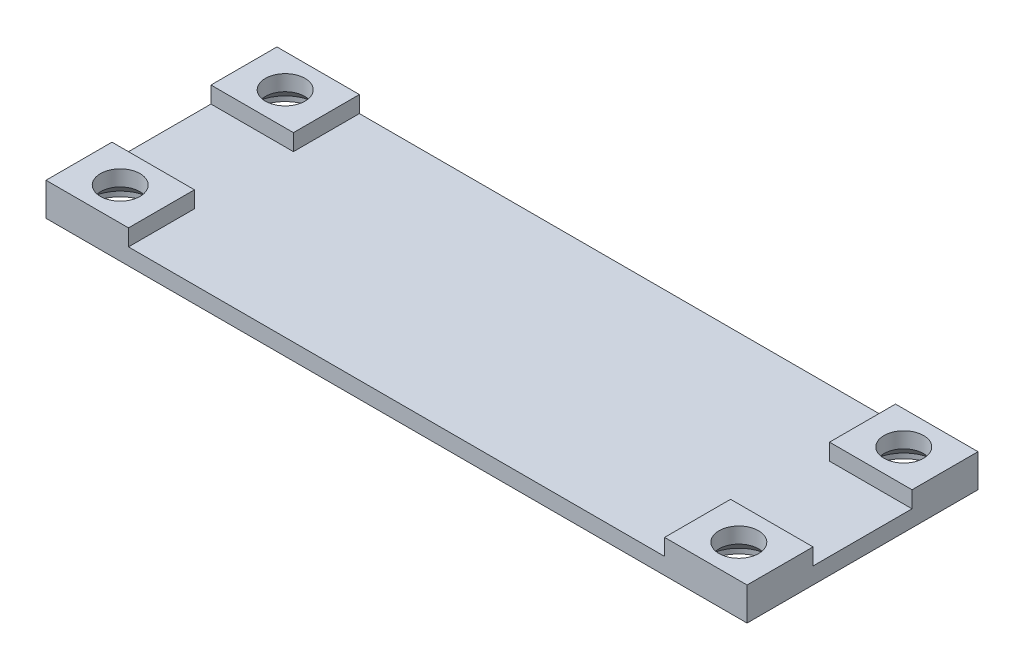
ISO-10303-21;
HEADER;
FILE_DESCRIPTION(('STEP AP214'),'2;1');
FILE_NAME('part.step','',(''),(''),'','','');
FILE_SCHEMA(('AUTOMOTIVE_DESIGN { 1 0 10303 214 1 1 1 1 }'));
ENDSEC;
DATA;
#1=APPLICATION_CONTEXT('core data for automotive mechanical design processes');
#2=APPLICATION_PROTOCOL_DEFINITION('international standard','automotive_design',2000,#1);
#3=PRODUCT_CONTEXT('',#1,'mechanical');
#4=PRODUCT('Part','Part','',(#3));
#5=PRODUCT_RELATED_PRODUCT_CATEGORY('part','',(#4));
#6=PRODUCT_DEFINITION_FORMATION('','',#4);
#7=PRODUCT_DEFINITION_CONTEXT('part definition',#1,'design');
#8=PRODUCT_DEFINITION('design','',#6,#7);
#9=PRODUCT_DEFINITION_SHAPE('','',#8);
#10=(LENGTH_UNIT() NAMED_UNIT(*) SI_UNIT(.MILLI.,.METRE.));
#11=(NAMED_UNIT(*) PLANE_ANGLE_UNIT() SI_UNIT($,.RADIAN.));
#12=(NAMED_UNIT(*) SI_UNIT($,.STERADIAN.) SOLID_ANGLE_UNIT());
#13=UNCERTAINTY_MEASURE_WITH_UNIT(LENGTH_MEASURE(1.E-05),#10,'distance_accuracy_value','');
#14=(GEOMETRIC_REPRESENTATION_CONTEXT(3) GLOBAL_UNCERTAINTY_ASSIGNED_CONTEXT((#13)) GLOBAL_UNIT_ASSIGNED_CONTEXT((#10,
#11,#12)) REPRESENTATION_CONTEXT('',''));
#15=CARTESIAN_POINT('',(0.,0.,0.));
#16=DIRECTION('',(0.,0.,1.));
#17=DIRECTION('',(1.,0.,0.));
#18=AXIS2_PLACEMENT_3D('',#15,#16,#17);
#19=CARTESIAN_POINT('',(0.,1.,-14.));
#20=DIRECTION('',(0.,-1.,0.));
#21=DIRECTION('',(0.,0.,-1.));
#22=AXIS2_PLACEMENT_3D('',#19,#20,#21);
#23=PLANE('',#22);
#24=DIRECTION('',(0.,0.,1.));
#25=VECTOR('',#24,1.);
#26=CARTESIAN_POINT('',(37.5,1.,-14.));
#27=LINE('',#26,#25);
#28=CARTESIAN_POINT('',(37.5,1.,-14.));
#29=VERTEX_POINT('',#28);
#30=CARTESIAN_POINT('',(37.5,1.,-10.));
#31=VERTEX_POINT('',#30);
#32=EDGE_CURVE('E303',#29,#31,#27,.T.);
#33=ORIENTED_EDGE('',*,*,#32,.F.);
#34=DIRECTION('',(-1.,0.,0.));
#35=VECTOR('',#34,1.);
#36=CARTESIAN_POINT('',(0.,1.,-14.));
#37=LINE('',#36,#35);
#38=CARTESIAN_POINT('',(5.,1.,-14.));
#39=VERTEX_POINT('',#38);
#40=EDGE_CURVE('E168',#29,#39,#37,.T.);
#41=ORIENTED_EDGE('',*,*,#40,.T.);
#42=DIRECTION('',(0.,0.,-1.));
#43=VECTOR('',#42,1.);
#44=CARTESIAN_POINT('',(5.,1.,-14.));
#45=LINE('',#44,#43);
#46=CARTESIAN_POINT('',(5.,1.,-10.));
#47=VERTEX_POINT('',#46);
#48=EDGE_CURVE('E227',#47,#39,#45,.T.);
#49=ORIENTED_EDGE('',*,*,#48,.F.);
#50=DIRECTION('',(1.,0.,0.));
#51=VECTOR('',#50,1.);
#52=CARTESIAN_POINT('',(0.,1.,-10.));
#53=LINE('',#52,#51);
#54=CARTESIAN_POINT('',(0.,1.,-10.));
#55=VERTEX_POINT('',#54);
#56=EDGE_CURVE('E222',#55,#47,#53,.T.);
#57=ORIENTED_EDGE('',*,*,#56,.F.);
#58=DIRECTION('',(0.,0.,1.));
#59=VECTOR('',#58,1.);
#60=CARTESIAN_POINT('',(0.,1.,0.));
#61=LINE('',#60,#59);
#62=CARTESIAN_POINT('',(0.,1.,-4.));
#63=VERTEX_POINT('',#62);
#64=EDGE_CURVE('E267',#55,#63,#61,.T.);
#65=ORIENTED_EDGE('',*,*,#64,.T.);
#66=DIRECTION('',(-1.,0.,0.));
#67=VECTOR('',#66,1.);
#68=CARTESIAN_POINT('',(0.,1.,-4.));
#69=LINE('',#68,#67);
#70=CARTESIAN_POINT('',(5.,1.,-4.));
#71=VERTEX_POINT('',#70);
#72=EDGE_CURVE('E203',#71,#63,#69,.T.);
#73=ORIENTED_EDGE('',*,*,#72,.F.);
#74=DIRECTION('',(0.,0.,-1.));
#75=VECTOR('',#74,1.);
#76=CARTESIAN_POINT('',(5.,1.,0.));
#77=LINE('',#76,#75);
#78=CARTESIAN_POINT('',(5.,1.,0.));
#79=VERTEX_POINT('',#78);
#80=EDGE_CURVE('E198',#79,#71,#77,.T.);
#81=ORIENTED_EDGE('',*,*,#80,.F.);
#82=DIRECTION('',(1.,0.,0.));
#83=VECTOR('',#82,1.);
#84=CARTESIAN_POINT('',(0.,1.,0.));
#85=LINE('',#84,#83);
#86=CARTESIAN_POINT('',(37.5,1.,0.));
#87=VERTEX_POINT('',#86);
#88=EDGE_CURVE('E275',#79,#87,#85,.T.);
#89=ORIENTED_EDGE('',*,*,#88,.T.);
#90=DIRECTION('',(0.,0.,1.));
#91=VECTOR('',#90,1.);
#92=CARTESIAN_POINT('',(37.5,1.,0.));
#93=LINE('',#92,#91);
#94=CARTESIAN_POINT('',(37.5,1.,-4.));
#95=VERTEX_POINT('',#94);
#96=EDGE_CURVE('E172',#95,#87,#93,.T.);
#97=ORIENTED_EDGE('',*,*,#96,.F.);
#98=DIRECTION('',(-1.,0.,0.));
#99=VECTOR('',#98,1.);
#100=CARTESIAN_POINT('',(42.5,1.,-4.00000000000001));
#101=LINE('',#100,#99);
#102=CARTESIAN_POINT('',(42.5,1.,-4.00000000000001));
#103=VERTEX_POINT('',#102);
#104=EDGE_CURVE('E169',#103,#95,#101,.T.);
#105=ORIENTED_EDGE('',*,*,#104,.F.);
#106=DIRECTION('',(0.,0.,-1.));
#107=VECTOR('',#106,1.);
#108=CARTESIAN_POINT('',(42.5,1.,0.));
#109=LINE('',#108,#107);
#110=CARTESIAN_POINT('',(42.5,1.,-10.));
#111=VERTEX_POINT('',#110);
#112=EDGE_CURVE('E54',#103,#111,#109,.T.);
#113=ORIENTED_EDGE('',*,*,#112,.T.);
#114=DIRECTION('',(1.,0.,0.));
#115=VECTOR('',#114,1.);
#116=CARTESIAN_POINT('',(42.5,1.,-10.));
#117=LINE('',#116,#115);
#118=EDGE_CURVE('E49',#31,#111,#117,.T.);
#119=ORIENTED_EDGE('',*,*,#118,.F.);
#120=EDGE_LOOP('',(#33,#41,#49,#57,#65,#73,#81,#89,#97,#105,#113,#119));
#121=FACE_BOUND('',#120,.T.);
#122=ADVANCED_FACE('F32',(#121),#23,.F.);
#123=CARTESIAN_POINT('',(0.,1.,0.));
#124=DIRECTION('',(1.,0.,0.));
#125=DIRECTION('',(0.,0.,-1.));
#126=AXIS2_PLACEMENT_3D('',#123,#124,#125);
#127=PLANE('',#126);
#128=DIRECTION('',(0.,0.,1.));
#129=VECTOR('',#128,1.);
#130=CARTESIAN_POINT('',(0.,0.,0.));
#131=LINE('',#130,#129);
#132=CARTESIAN_POINT('',(0.,0.,-14.));
#133=VERTEX_POINT('',#132);
#134=CARTESIAN_POINT('',(0.,0.,0.));
#135=VERTEX_POINT('',#134);
#136=EDGE_CURVE('E257',#133,#135,#131,.T.);
#137=ORIENTED_EDGE('',*,*,#136,.T.);
#138=DIRECTION('',(0.,-1.,0.));
#139=VECTOR('',#138,1.);
#140=CARTESIAN_POINT('',(0.,1.,0.));
#141=LINE('',#140,#139);
#142=CARTESIAN_POINT('',(0.,2.,0.));
#143=VERTEX_POINT('',#142);
#144=EDGE_CURVE('E11',#143,#135,#141,.T.);
#145=ORIENTED_EDGE('',*,*,#144,.F.);
#146=DIRECTION('',(0.,0.,1.));
#147=VECTOR('',#146,1.);
#148=CARTESIAN_POINT('',(0.,2.,0.));
#149=LINE('',#148,#147);
#150=CARTESIAN_POINT('',(0.,2.,-4.));
#151=VERTEX_POINT('',#150);
#152=EDGE_CURVE('E199',#151,#143,#149,.T.);
#153=ORIENTED_EDGE('',*,*,#152,.F.);
#154=DIRECTION('',(0.,-1.,0.));
#155=VECTOR('',#154,1.);
#156=CARTESIAN_POINT('',(0.,2.,-4.));
#157=LINE('',#156,#155);
#158=EDGE_CURVE('E209',#151,#63,#157,.T.);
#159=ORIENTED_EDGE('',*,*,#158,.T.);
#160=ORIENTED_EDGE('',*,*,#64,.F.);
#161=DIRECTION('',(0.,-1.,0.));
#162=VECTOR('',#161,1.);
#163=CARTESIAN_POINT('',(0.,2.,-10.));
#164=LINE('',#163,#162);
#165=CARTESIAN_POINT('',(0.,2.,-10.));
#166=VERTEX_POINT('',#165);
#167=EDGE_CURVE('E261',#166,#55,#164,.T.);
#168=ORIENTED_EDGE('',*,*,#167,.F.);
#169=DIRECTION('',(0.,0.,1.));
#170=VECTOR('',#169,1.);
#171=CARTESIAN_POINT('',(0.,2.,-14.));
#172=LINE('',#171,#170);
#173=CARTESIAN_POINT('',(0.,2.,-14.));
#174=VERTEX_POINT('',#173);
#175=EDGE_CURVE('E223',#174,#166,#172,.T.);
#176=ORIENTED_EDGE('',*,*,#175,.F.);
#177=DIRECTION('',(0.,-1.,0.));
#178=VECTOR('',#177,1.);
#179=CARTESIAN_POINT('',(0.,1.,-14.));
#180=LINE('',#179,#178);
#181=EDGE_CURVE('E250',#174,#133,#180,.T.);
#182=ORIENTED_EDGE('',*,*,#181,.T.);
#183=EDGE_LOOP('',(#137,#145,#153,#159,#160,#168,#176,#182));
#184=FACE_BOUND('',#183,.T.);
#185=ADVANCED_FACE('F34',(#184),#127,.F.);
#186=CARTESIAN_POINT('',(0.,1.,0.));
#187=DIRECTION('',(0.,0.,-1.));
#188=DIRECTION('',(-1.,0.,0.));
#189=AXIS2_PLACEMENT_3D('',#186,#187,#188);
#190=PLANE('',#189);
#191=DIRECTION('',(1.,0.,0.));
#192=VECTOR('',#191,1.);
#193=CARTESIAN_POINT('',(0.,0.,0.));
#194=LINE('',#193,#192);
#195=CARTESIAN_POINT('',(42.5,0.,0.));
#196=VERTEX_POINT('',#195);
#197=EDGE_CURVE('E260',#135,#196,#194,.T.);
#198=ORIENTED_EDGE('',*,*,#197,.T.);
#199=DIRECTION('',(0.,-1.,0.));
#200=VECTOR('',#199,1.);
#201=CARTESIAN_POINT('',(42.5,1.,0.));
#202=LINE('',#201,#200);
#203=CARTESIAN_POINT('',(42.5,2.,0.));
#204=VERTEX_POINT('',#203);
#205=EDGE_CURVE('E41',#204,#196,#202,.T.);
#206=ORIENTED_EDGE('',*,*,#205,.F.);
#207=DIRECTION('',(1.,0.,0.));
#208=VECTOR('',#207,1.);
#209=CARTESIAN_POINT('',(42.5,2.,0.));
#210=LINE('',#209,#208);
#211=CARTESIAN_POINT('',(37.5,2.,0.));
#212=VERTEX_POINT('',#211);
#213=EDGE_CURVE('E178',#212,#204,#210,.T.);
#214=ORIENTED_EDGE('',*,*,#213,.F.);
#215=DIRECTION('',(0.,-1.,0.));
#216=VECTOR('',#215,1.);
#217=CARTESIAN_POINT('',(37.5,2.,0.));
#218=LINE('',#217,#216);
#219=EDGE_CURVE('E186',#212,#87,#218,.T.);
#220=ORIENTED_EDGE('',*,*,#219,.T.);
#221=ORIENTED_EDGE('',*,*,#88,.F.);
#222=DIRECTION('',(0.,-1.,0.));
#223=VECTOR('',#222,1.);
#224=CARTESIAN_POINT('',(5.,2.,0.));
#225=LINE('',#224,#223);
#226=CARTESIAN_POINT('',(5.,2.,0.));
#227=VERTEX_POINT('',#226);
#228=EDGE_CURVE('E219',#227,#79,#225,.T.);
#229=ORIENTED_EDGE('',*,*,#228,.F.);
#230=DIRECTION('',(1.,0.,0.));
#231=VECTOR('',#230,1.);
#232=CARTESIAN_POINT('',(0.,2.,0.));
#233=LINE('',#232,#231);
#234=EDGE_CURVE('E202',#143,#227,#233,.T.);
#235=ORIENTED_EDGE('',*,*,#234,.F.);
#236=ORIENTED_EDGE('',*,*,#144,.T.);
#237=EDGE_LOOP('',(#198,#206,#214,#220,#221,#229,#235,#236));
#238=FACE_BOUND('',#237,.T.);
#239=ADVANCED_FACE('F287',(#238),#190,.F.);
#240=CARTESIAN_POINT('',(42.5,1.,0.));
#241=DIRECTION('',(-1.,0.,0.));
#242=DIRECTION('',(0.,0.,1.));
#243=AXIS2_PLACEMENT_3D('',#240,#241,#242);
#244=PLANE('',#243);
#245=DIRECTION('',(0.,0.,-1.));
#246=VECTOR('',#245,1.);
#247=CARTESIAN_POINT('',(42.5,0.,0.));
#248=LINE('',#247,#246);
#249=CARTESIAN_POINT('',(42.5,0.,-14.));
#250=VERTEX_POINT('',#249);
#251=EDGE_CURVE('E263',#196,#250,#248,.T.);
#252=ORIENTED_EDGE('',*,*,#251,.T.);
#253=DIRECTION('',(0.,-1.,0.));
#254=VECTOR('',#253,1.);
#255=CARTESIAN_POINT('',(42.5,1.,-14.));
#256=LINE('',#255,#254);
#257=CARTESIAN_POINT('',(42.5,2.,-14.));
#258=VERTEX_POINT('',#257);
#259=EDGE_CURVE('E270',#258,#250,#256,.T.);
#260=ORIENTED_EDGE('',*,*,#259,.F.);
#261=DIRECTION('',(0.,0.,-1.));
#262=VECTOR('',#261,1.);
#263=CARTESIAN_POINT('',(42.5,2.,-14.));
#264=LINE('',#263,#262);
#265=CARTESIAN_POINT('',(42.5,2.,-10.));
#266=VERTEX_POINT('',#265);
#267=EDGE_CURVE('E162',#266,#258,#264,.T.);
#268=ORIENTED_EDGE('',*,*,#267,.F.);
#269=DIRECTION('',(0.,-1.,0.));
#270=VECTOR('',#269,1.);
#271=CARTESIAN_POINT('',(42.5,2.,-10.));
#272=LINE('',#271,#270);
#273=EDGE_CURVE('E174',#266,#111,#272,.T.);
#274=ORIENTED_EDGE('',*,*,#273,.T.);
#275=ORIENTED_EDGE('',*,*,#112,.F.);
#276=DIRECTION('',(0.,-1.,0.));
#277=VECTOR('',#276,1.);
#278=CARTESIAN_POINT('',(42.5,2.,-4.00000000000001));
#279=LINE('',#278,#277);
#280=CARTESIAN_POINT('',(42.5,2.,-4.00000000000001));
#281=VERTEX_POINT('',#280);
#282=EDGE_CURVE('E195',#281,#103,#279,.T.);
#283=ORIENTED_EDGE('',*,*,#282,.F.);
#284=DIRECTION('',(0.,0.,-1.));
#285=VECTOR('',#284,1.);
#286=CARTESIAN_POINT('',(42.5,2.,0.));
#287=LINE('',#286,#285);
#288=EDGE_CURVE('E181',#204,#281,#287,.T.);
#289=ORIENTED_EDGE('',*,*,#288,.F.);
#290=ORIENTED_EDGE('',*,*,#205,.T.);
#291=EDGE_LOOP('',(#252,#260,#268,#274,#275,#283,#289,#290));
#292=FACE_BOUND('',#291,.T.);
#293=ADVANCED_FACE('F296',(#292),#244,.F.);
#294=CARTESIAN_POINT('',(0.,1.,-14.));
#295=DIRECTION('',(0.,0.,1.));
#296=DIRECTION('',(1.,0.,0.));
#297=AXIS2_PLACEMENT_3D('',#294,#295,#296);
#298=PLANE('',#297);
#299=DIRECTION('',(-1.,0.,0.));
#300=VECTOR('',#299,1.);
#301=CARTESIAN_POINT('',(0.,0.,-14.));
#302=LINE('',#301,#300);
#303=EDGE_CURVE('E265',#250,#133,#302,.T.);
#304=ORIENTED_EDGE('',*,*,#303,.T.);
#305=ORIENTED_EDGE('',*,*,#181,.F.);
#306=DIRECTION('',(-1.,0.,0.));
#307=VECTOR('',#306,1.);
#308=CARTESIAN_POINT('',(0.,2.,-14.));
#309=LINE('',#308,#307);
#310=CARTESIAN_POINT('',(5.,2.,-14.));
#311=VERTEX_POINT('',#310);
#312=EDGE_CURVE('E231',#311,#174,#309,.T.);
#313=ORIENTED_EDGE('',*,*,#312,.F.);
#314=DIRECTION('',(0.,-1.,0.));
#315=VECTOR('',#314,1.);
#316=CARTESIAN_POINT('',(5.,2.,-14.));
#317=LINE('',#316,#315);
#318=EDGE_CURVE('E234',#311,#39,#317,.T.);
#319=ORIENTED_EDGE('',*,*,#318,.T.);
#320=ORIENTED_EDGE('',*,*,#40,.F.);
#321=DIRECTION('',(0.,-1.,0.));
#322=VECTOR('',#321,1.);
#323=CARTESIAN_POINT('',(37.5,2.,-14.));
#324=LINE('',#323,#322);
#325=CARTESIAN_POINT('',(37.5,2.,-14.));
#326=VERTEX_POINT('',#325);
#327=EDGE_CURVE('E150',#326,#29,#324,.T.);
#328=ORIENTED_EDGE('',*,*,#327,.F.);
#329=DIRECTION('',(-1.,0.,0.));
#330=VECTOR('',#329,1.);
#331=CARTESIAN_POINT('',(42.5,2.,-14.));
#332=LINE('',#331,#330);
#333=EDGE_CURVE('E156',#258,#326,#332,.T.);
#334=ORIENTED_EDGE('',*,*,#333,.F.);
#335=ORIENTED_EDGE('',*,*,#259,.T.);
#336=EDGE_LOOP('',(#304,#305,#313,#319,#320,#328,#334,#335));
#337=FACE_BOUND('',#336,.T.);
#338=ADVANCED_FACE('F166',(#337),#298,.F.);
#339=CARTESIAN_POINT('',(0.,0.,-14.));
#340=DIRECTION('',(0.,-1.,0.));
#341=DIRECTION('',(0.,0.,-1.));
#342=AXIS2_PLACEMENT_3D('',#339,#340,#341);
#343=PLANE('',#342);
#344=CARTESIAN_POINT('',(2.5,0.,-2.));
#345=DIRECTION('',(0.,-1.,0.));
#346=DIRECTION('',(0.,0.,-1.));
#347=AXIS2_PLACEMENT_3D('',#344,#345,#346);
#348=CIRCLE('',#347,1.95);
#349=CARTESIAN_POINT('',(2.5,0.,-3.95));
#350=VERTEX_POINT('',#349);
#351=EDGE_CURVE('E341',#350,#350,#348,.T.);
#352=ORIENTED_EDGE('',*,*,#351,.F.);
#353=EDGE_LOOP('',(#352));
#354=FACE_BOUND('',#353,.T.);
#355=CARTESIAN_POINT('',(2.5,0.,-12.));
#356=DIRECTION('',(0.,-1.,0.));
#357=DIRECTION('',(0.,0.,-1.));
#358=AXIS2_PLACEMENT_3D('',#355,#356,#357);
#359=CIRCLE('',#358,1.95);
#360=CARTESIAN_POINT('',(2.5,0.,-13.95));
#361=VERTEX_POINT('',#360);
#362=EDGE_CURVE('E332',#361,#361,#359,.T.);
#363=ORIENTED_EDGE('',*,*,#362,.F.);
#364=EDGE_LOOP('',(#363));
#365=FACE_BOUND('',#364,.T.);
#366=CARTESIAN_POINT('',(40.,0.,-12.));
#367=DIRECTION('',(0.,-1.,0.));
#368=DIRECTION('',(0.,0.,-1.));
#369=AXIS2_PLACEMENT_3D('',#366,#367,#368);
#370=CIRCLE('',#369,1.95);
#371=CARTESIAN_POINT('',(40.,0.,-13.95));
#372=VERTEX_POINT('',#371);
#373=EDGE_CURVE('E322',#372,#372,#370,.T.);
#374=ORIENTED_EDGE('',*,*,#373,.F.);
#375=EDGE_LOOP('',(#374));
#376=FACE_BOUND('',#375,.T.);
#377=CARTESIAN_POINT('',(40.,0.,-2.));
#378=DIRECTION('',(0.,-1.,0.));
#379=DIRECTION('',(0.,0.,-1.));
#380=AXIS2_PLACEMENT_3D('',#377,#378,#379);
#381=CIRCLE('',#380,1.95);
#382=CARTESIAN_POINT('',(40.,0.,-3.95));
#383=VERTEX_POINT('',#382);
#384=EDGE_CURVE('E312',#383,#383,#381,.T.);
#385=ORIENTED_EDGE('',*,*,#384,.F.);
#386=EDGE_LOOP('',(#385));
#387=FACE_BOUND('',#386,.T.);
#388=ORIENTED_EDGE('',*,*,#136,.F.);
#389=ORIENTED_EDGE('',*,*,#303,.F.);
#390=ORIENTED_EDGE('',*,*,#251,.F.);
#391=ORIENTED_EDGE('',*,*,#197,.F.);
#392=EDGE_LOOP('',(#388,#389,#390,#391));
#393=FACE_BOUND('',#392,.T.);
#394=ADVANCED_FACE('F347',(#354,#365,#376,#387,#393),#343,.T.);
#395=CARTESIAN_POINT('',(0.,2.,-10.));
#396=DIRECTION('',(0.,0.,-1.));
#397=DIRECTION('',(-1.,0.,0.));
#398=AXIS2_PLACEMENT_3D('',#395,#396,#397);
#399=PLANE('',#398);
#400=ORIENTED_EDGE('',*,*,#56,.T.);
#401=DIRECTION('',(0.,-1.,0.));
#402=VECTOR('',#401,1.);
#403=CARTESIAN_POINT('',(5.,2.,-10.));
#404=LINE('',#403,#402);
#405=CARTESIAN_POINT('',(5.,2.,-10.));
#406=VERTEX_POINT('',#405);
#407=EDGE_CURVE('E237',#406,#47,#404,.T.);
#408=ORIENTED_EDGE('',*,*,#407,.F.);
#409=DIRECTION('',(1.,0.,0.));
#410=VECTOR('',#409,1.);
#411=CARTESIAN_POINT('',(0.,2.,-10.));
#412=LINE('',#411,#410);
#413=EDGE_CURVE('E226',#166,#406,#412,.T.);
#414=ORIENTED_EDGE('',*,*,#413,.F.);
#415=ORIENTED_EDGE('',*,*,#167,.T.);
#416=EDGE_LOOP('',(#400,#408,#414,#415));
#417=FACE_BOUND('',#416,.T.);
#418=ADVANCED_FACE('F350',(#417),#399,.F.);
#419=CARTESIAN_POINT('',(5.,2.,-14.));
#420=DIRECTION('',(-1.,0.,0.));
#421=DIRECTION('',(0.,0.,1.));
#422=AXIS2_PLACEMENT_3D('',#419,#420,#421);
#423=PLANE('',#422);
#424=ORIENTED_EDGE('',*,*,#48,.T.);
#425=ORIENTED_EDGE('',*,*,#318,.F.);
#426=DIRECTION('',(0.,0.,-1.));
#427=VECTOR('',#426,1.);
#428=CARTESIAN_POINT('',(5.,2.,-14.));
#429=LINE('',#428,#427);
#430=EDGE_CURVE('E229',#406,#311,#429,.T.);
#431=ORIENTED_EDGE('',*,*,#430,.F.);
#432=ORIENTED_EDGE('',*,*,#407,.T.);
#433=EDGE_LOOP('',(#424,#425,#431,#432));
#434=FACE_BOUND('',#433,.T.);
#435=ADVANCED_FACE('F374',(#434),#423,.F.);
#436=CARTESIAN_POINT('',(0.,2.,-10.));
#437=DIRECTION('',(0.,1.,0.));
#438=DIRECTION('',(0.,0.,1.));
#439=AXIS2_PLACEMENT_3D('',#436,#437,#438);
#440=PLANE('',#439);
#441=CARTESIAN_POINT('',(2.5,2.,-12.));
#442=DIRECTION('',(0.,1.,0.));
#443=DIRECTION('',(0.,0.,1.));
#444=AXIS2_PLACEMENT_3D('',#441,#442,#443);
#445=CIRCLE('',#444,1.2);
#446=CARTESIAN_POINT('',(2.5,2.,-10.8));
#447=VERTEX_POINT('',#446);
#448=EDGE_CURVE('E325',#447,#447,#445,.T.);
#449=ORIENTED_EDGE('',*,*,#448,.F.);
#450=EDGE_LOOP('',(#449));
#451=FACE_BOUND('',#450,.T.);
#452=ORIENTED_EDGE('',*,*,#175,.T.);
#453=ORIENTED_EDGE('',*,*,#413,.T.);
#454=ORIENTED_EDGE('',*,*,#430,.T.);
#455=ORIENTED_EDGE('',*,*,#312,.T.);
#456=EDGE_LOOP('',(#452,#453,#454,#455));
#457=FACE_BOUND('',#456,.T.);
#458=ADVANCED_FACE('F368',(#451,#457),#440,.T.);
#459=CARTESIAN_POINT('',(5.,2.,0.));
#460=DIRECTION('',(-1.,0.,0.));
#461=DIRECTION('',(0.,0.,1.));
#462=AXIS2_PLACEMENT_3D('',#459,#460,#461);
#463=PLANE('',#462);
#464=ORIENTED_EDGE('',*,*,#80,.T.);
#465=DIRECTION('',(0.,-1.,0.));
#466=VECTOR('',#465,1.);
#467=CARTESIAN_POINT('',(5.,2.,-4.));
#468=LINE('',#467,#466);
#469=CARTESIAN_POINT('',(5.,2.,-4.));
#470=VERTEX_POINT('',#469);
#471=EDGE_CURVE('E216',#470,#71,#468,.T.);
#472=ORIENTED_EDGE('',*,*,#471,.F.);
#473=DIRECTION('',(0.,0.,-1.));
#474=VECTOR('',#473,1.);
#475=CARTESIAN_POINT('',(5.,2.,0.));
#476=LINE('',#475,#474);
#477=EDGE_CURVE('E205',#227,#470,#476,.T.);
#478=ORIENTED_EDGE('',*,*,#477,.F.);
#479=ORIENTED_EDGE('',*,*,#228,.T.);
#480=EDGE_LOOP('',(#464,#472,#478,#479));
#481=FACE_BOUND('',#480,.T.);
#482=ADVANCED_FACE('F387',(#481),#463,.F.);
#483=CARTESIAN_POINT('',(0.,2.,-4.));
#484=DIRECTION('',(0.,0.,1.));
#485=DIRECTION('',(1.,0.,0.));
#486=AXIS2_PLACEMENT_3D('',#483,#484,#485);
#487=PLANE('',#486);
#488=ORIENTED_EDGE('',*,*,#72,.T.);
#489=ORIENTED_EDGE('',*,*,#158,.F.);
#490=DIRECTION('',(-1.,0.,0.));
#491=VECTOR('',#490,1.);
#492=CARTESIAN_POINT('',(0.,2.,-4.));
#493=LINE('',#492,#491);
#494=EDGE_CURVE('E207',#470,#151,#493,.T.);
#495=ORIENTED_EDGE('',*,*,#494,.F.);
#496=ORIENTED_EDGE('',*,*,#471,.T.);
#497=EDGE_LOOP('',(#488,#489,#495,#496));
#498=FACE_BOUND('',#497,.T.);
#499=ADVANCED_FACE('F382',(#498),#487,.F.);
#500=CARTESIAN_POINT('',(0.,2.,-4.));
#501=DIRECTION('',(0.,-1.,0.));
#502=DIRECTION('',(0.,0.,-1.));
#503=AXIS2_PLACEMENT_3D('',#500,#501,#502);
#504=PLANE('',#503);
#505=CARTESIAN_POINT('',(2.5,2.,-2.));
#506=DIRECTION('',(0.,-1.,0.));
#507=DIRECTION('',(0.,0.,-1.));
#508=AXIS2_PLACEMENT_3D('',#505,#506,#507);
#509=CIRCLE('',#508,1.2);
#510=CARTESIAN_POINT('',(2.5,2.,-3.2));
#511=VERTEX_POINT('',#510);
#512=EDGE_CURVE('E36',#511,#511,#509,.T.);
#513=ORIENTED_EDGE('',*,*,#512,.T.);
#514=EDGE_LOOP('',(#513));
#515=FACE_BOUND('',#514,.T.);
#516=ORIENTED_EDGE('',*,*,#152,.T.);
#517=ORIENTED_EDGE('',*,*,#234,.T.);
#518=ORIENTED_EDGE('',*,*,#477,.T.);
#519=ORIENTED_EDGE('',*,*,#494,.T.);
#520=EDGE_LOOP('',(#516,#517,#518,#519));
#521=FACE_BOUND('',#520,.T.);
#522=ADVANCED_FACE('F389',(#515,#521),#504,.F.);
#523=CARTESIAN_POINT('',(42.5,2.,-4.00000000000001));
#524=DIRECTION('',(0.,0.,1.));
#525=DIRECTION('',(1.,0.,0.));
#526=AXIS2_PLACEMENT_3D('',#523,#524,#525);
#527=PLANE('',#526);
#528=ORIENTED_EDGE('',*,*,#104,.T.);
#529=DIRECTION('',(0.,-1.,0.));
#530=VECTOR('',#529,1.);
#531=CARTESIAN_POINT('',(37.5,2.,-4.));
#532=LINE('',#531,#530);
#533=CARTESIAN_POINT('',(37.5,2.,-4.));
#534=VERTEX_POINT('',#533);
#535=EDGE_CURVE('E192',#534,#95,#532,.T.);
#536=ORIENTED_EDGE('',*,*,#535,.F.);
#537=DIRECTION('',(-1.,0.,0.));
#538=VECTOR('',#537,1.);
#539=CARTESIAN_POINT('',(42.5,2.,-4.00000000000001));
#540=LINE('',#539,#538);
#541=EDGE_CURVE('E183',#281,#534,#540,.T.);
#542=ORIENTED_EDGE('',*,*,#541,.F.);
#543=ORIENTED_EDGE('',*,*,#282,.T.);
#544=EDGE_LOOP('',(#528,#536,#542,#543));
#545=FACE_BOUND('',#544,.T.);
#546=ADVANCED_FACE('F294',(#545),#527,.F.);
#547=CARTESIAN_POINT('',(37.5,2.,0.));
#548=DIRECTION('',(1.,0.,0.));
#549=DIRECTION('',(0.,0.,-1.));
#550=AXIS2_PLACEMENT_3D('',#547,#548,#549);
#551=PLANE('',#550);
#552=ORIENTED_EDGE('',*,*,#96,.T.);
#553=ORIENTED_EDGE('',*,*,#219,.F.);
#554=DIRECTION('',(0.,0.,1.));
#555=VECTOR('',#554,1.);
#556=CARTESIAN_POINT('',(37.5,2.,0.));
#557=LINE('',#556,#555);
#558=EDGE_CURVE('E185',#534,#212,#557,.T.);
#559=ORIENTED_EDGE('',*,*,#558,.F.);
#560=ORIENTED_EDGE('',*,*,#535,.T.);
#561=EDGE_LOOP('',(#552,#553,#559,#560));
#562=FACE_BOUND('',#561,.T.);
#563=ADVANCED_FACE('F283',(#562),#551,.F.);
#564=CARTESIAN_POINT('',(37.5,2.,0.));
#565=DIRECTION('',(0.,-1.,0.));
#566=DIRECTION('',(0.,0.,-1.));
#567=AXIS2_PLACEMENT_3D('',#564,#565,#566);
#568=PLANE('',#567);
#569=CARTESIAN_POINT('',(40.,2.,-2.));
#570=DIRECTION('',(0.,-1.,0.));
#571=DIRECTION('',(0.,0.,-1.));
#572=AXIS2_PLACEMENT_3D('',#569,#570,#571);
#573=CIRCLE('',#572,1.2);
#574=CARTESIAN_POINT('',(40.,2.,-3.2));
#575=VERTEX_POINT('',#574);
#576=EDGE_CURVE('E251',#575,#575,#573,.T.);
#577=ORIENTED_EDGE('',*,*,#576,.T.);
#578=EDGE_LOOP('',(#577));
#579=FACE_BOUND('',#578,.T.);
#580=ORIENTED_EDGE('',*,*,#213,.T.);
#581=ORIENTED_EDGE('',*,*,#288,.T.);
#582=ORIENTED_EDGE('',*,*,#541,.T.);
#583=ORIENTED_EDGE('',*,*,#558,.T.);
#584=EDGE_LOOP('',(#580,#581,#582,#583));
#585=FACE_BOUND('',#584,.T.);
#586=ADVANCED_FACE('F290',(#579,#585),#568,.F.);
#587=CARTESIAN_POINT('',(37.5,2.,-14.));
#588=DIRECTION('',(1.,0.,0.));
#589=DIRECTION('',(0.,0.,-1.));
#590=AXIS2_PLACEMENT_3D('',#587,#588,#589);
#591=PLANE('',#590);
#592=ORIENTED_EDGE('',*,*,#32,.T.);
#593=DIRECTION('',(0.,-1.,0.));
#594=VECTOR('',#593,1.);
#595=CARTESIAN_POINT('',(37.5,2.,-10.));
#596=LINE('',#595,#594);
#597=CARTESIAN_POINT('',(37.5,2.,-10.));
#598=VERTEX_POINT('',#597);
#599=EDGE_CURVE('E152',#598,#31,#596,.T.);
#600=ORIENTED_EDGE('',*,*,#599,.F.);
#601=DIRECTION('',(0.,0.,1.));
#602=VECTOR('',#601,1.);
#603=CARTESIAN_POINT('',(37.5,2.,-14.));
#604=LINE('',#603,#602);
#605=EDGE_CURVE('E146',#326,#598,#604,.T.);
#606=ORIENTED_EDGE('',*,*,#605,.F.);
#607=ORIENTED_EDGE('',*,*,#327,.T.);
#608=EDGE_LOOP('',(#592,#600,#606,#607));
#609=FACE_BOUND('',#608,.T.);
#610=ADVANCED_FACE('F148',(#609),#591,.F.);
#611=CARTESIAN_POINT('',(42.5,2.,-10.));
#612=DIRECTION('',(0.,0.,-1.));
#613=DIRECTION('',(-1.,0.,0.));
#614=AXIS2_PLACEMENT_3D('',#611,#612,#613);
#615=PLANE('',#614);
#616=ORIENTED_EDGE('',*,*,#118,.T.);
#617=ORIENTED_EDGE('',*,*,#273,.F.);
#618=DIRECTION('',(1.,0.,0.));
#619=VECTOR('',#618,1.);
#620=CARTESIAN_POINT('',(42.5,2.,-10.));
#621=LINE('',#620,#619);
#622=EDGE_CURVE('E155',#598,#266,#621,.T.);
#623=ORIENTED_EDGE('',*,*,#622,.F.);
#624=ORIENTED_EDGE('',*,*,#599,.T.);
#625=EDGE_LOOP('',(#616,#617,#623,#624));
#626=FACE_BOUND('',#625,.T.);
#627=ADVANCED_FACE('F481',(#626),#615,.F.);
#628=CARTESIAN_POINT('',(37.5,2.,-14.));
#629=DIRECTION('',(0.,1.,0.));
#630=DIRECTION('',(0.,0.,1.));
#631=AXIS2_PLACEMENT_3D('',#628,#629,#630);
#632=PLANE('',#631);
#633=CARTESIAN_POINT('',(40.,2.,-12.));
#634=DIRECTION('',(0.,1.,0.));
#635=DIRECTION('',(0.,0.,1.));
#636=AXIS2_PLACEMENT_3D('',#633,#634,#635);
#637=CIRCLE('',#636,1.2);
#638=CARTESIAN_POINT('',(40.,2.,-10.8));
#639=VERTEX_POINT('',#638);
#640=EDGE_CURVE('E315',#639,#639,#637,.T.);
#641=ORIENTED_EDGE('',*,*,#640,.F.);
#642=EDGE_LOOP('',(#641));
#643=FACE_BOUND('',#642,.T.);
#644=ORIENTED_EDGE('',*,*,#333,.T.);
#645=ORIENTED_EDGE('',*,*,#605,.T.);
#646=ORIENTED_EDGE('',*,*,#622,.T.);
#647=ORIENTED_EDGE('',*,*,#267,.T.);
#648=EDGE_LOOP('',(#644,#645,#646,#647));
#649=FACE_BOUND('',#648,.T.);
#650=ADVANCED_FACE('F160',(#643,#649),#632,.T.);
#651=CARTESIAN_POINT('',(40.,0.,-2.));
#652=DIRECTION('',(0.,-1.,0.));
#653=DIRECTION('',(0.,0.,-1.));
#654=AXIS2_PLACEMENT_3D('',#651,#652,#653);
#655=CYLINDRICAL_SURFACE('',#654,1.2);
#656=CARTESIAN_POINT('',(40.,1.05,-2.));
#657=DIRECTION('',(0.,-1.,0.));
#658=DIRECTION('',(0.,0.,-1.));
#659=AXIS2_PLACEMENT_3D('',#656,#657,#658);
#660=CIRCLE('',#659,1.2);
#661=CARTESIAN_POINT('',(40.,1.05,-3.2));
#662=VERTEX_POINT('',#661);
#663=EDGE_CURVE('E306',#662,#662,#660,.T.);
#664=ORIENTED_EDGE('',*,*,#663,.T.);
#665=EDGE_LOOP('',(#664));
#666=FACE_BOUND('',#665,.T.);
#667=ORIENTED_EDGE('',*,*,#576,.F.);
#668=EDGE_LOOP('',(#667));
#669=FACE_BOUND('',#668,.T.);
#670=ADVANCED_FACE('F498',(#666,#669),#655,.F.);
#671=CARTESIAN_POINT('',(40.,0.3,-2.));
#672=DIRECTION('',(0.,-1.,0.));
#673=DIRECTION('',(0.,0.,-1.));
#674=AXIS2_PLACEMENT_3D('',#671,#672,#673);
#675=CONICAL_SURFACE('',#674,1.95,0.785398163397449);
#676=ORIENTED_EDGE('',*,*,#663,.F.);
#677=EDGE_LOOP('',(#676));
#678=FACE_BOUND('',#677,.T.);
#679=CARTESIAN_POINT('',(40.,0.3,-2.));
#680=DIRECTION('',(0.,-1.,0.));
#681=DIRECTION('',(0.,0.,-1.));
#682=AXIS2_PLACEMENT_3D('',#679,#680,#681);
#683=CIRCLE('',#682,1.95);
#684=CARTESIAN_POINT('',(40.,0.3,-3.95));
#685=VERTEX_POINT('',#684);
#686=EDGE_CURVE('E309',#685,#685,#683,.T.);
#687=ORIENTED_EDGE('',*,*,#686,.T.);
#688=EDGE_LOOP('',(#687));
#689=FACE_BOUND('',#688,.T.);
#690=ADVANCED_FACE('F506',(#678,#689),#675,.F.);
#691=CARTESIAN_POINT('',(40.,0.,-2.));
#692=DIRECTION('',(0.,-1.,0.));
#693=DIRECTION('',(0.,0.,-1.));
#694=AXIS2_PLACEMENT_3D('',#691,#692,#693);
#695=CYLINDRICAL_SURFACE('',#694,1.95);
#696=ORIENTED_EDGE('',*,*,#686,.F.);
#697=EDGE_LOOP('',(#696));
#698=FACE_BOUND('',#697,.T.);
#699=ORIENTED_EDGE('',*,*,#384,.T.);
#700=EDGE_LOOP('',(#699));
#701=FACE_BOUND('',#700,.T.);
#702=ADVANCED_FACE('F514',(#698,#701),#695,.F.);
#703=CARTESIAN_POINT('',(40.,0.,-12.));
#704=DIRECTION('',(0.,-1.,0.));
#705=DIRECTION('',(0.,0.,-1.));
#706=AXIS2_PLACEMENT_3D('',#703,#704,#705);
#707=CYLINDRICAL_SURFACE('',#706,1.2);
#708=ORIENTED_EDGE('',*,*,#640,.T.);
#709=EDGE_LOOP('',(#708));
#710=FACE_BOUND('',#709,.T.);
#711=CARTESIAN_POINT('',(40.,1.05,-12.));
#712=DIRECTION('',(0.,-1.,0.));
#713=DIRECTION('',(0.,0.,-1.));
#714=AXIS2_PLACEMENT_3D('',#711,#712,#713);
#715=CIRCLE('',#714,1.2);
#716=CARTESIAN_POINT('',(40.,1.05,-13.2));
#717=VERTEX_POINT('',#716);
#718=EDGE_CURVE('E316',#717,#717,#715,.T.);
#719=ORIENTED_EDGE('',*,*,#718,.T.);
#720=EDGE_LOOP('',(#719));
#721=FACE_BOUND('',#720,.T.);
#722=ADVANCED_FACE('F522',(#710,#721),#707,.F.);
#723=CARTESIAN_POINT('',(40.,0.3,-12.));
#724=DIRECTION('',(0.,-1.,0.));
#725=DIRECTION('',(0.,0.,-1.));
#726=AXIS2_PLACEMENT_3D('',#723,#724,#725);
#727=CONICAL_SURFACE('',#726,1.95,0.785398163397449);
#728=ORIENTED_EDGE('',*,*,#718,.F.);
#729=EDGE_LOOP('',(#728));
#730=FACE_BOUND('',#729,.T.);
#731=CARTESIAN_POINT('',(40.,0.3,-12.));
#732=DIRECTION('',(0.,-1.,0.));
#733=DIRECTION('',(0.,0.,-1.));
#734=AXIS2_PLACEMENT_3D('',#731,#732,#733);
#735=CIRCLE('',#734,1.95);
#736=CARTESIAN_POINT('',(40.,0.3,-13.95));
#737=VERTEX_POINT('',#736);
#738=EDGE_CURVE('E319',#737,#737,#735,.T.);
#739=ORIENTED_EDGE('',*,*,#738,.T.);
#740=EDGE_LOOP('',(#739));
#741=FACE_BOUND('',#740,.T.);
#742=ADVANCED_FACE('F530',(#730,#741),#727,.F.);
#743=CARTESIAN_POINT('',(40.,0.,-12.));
#744=DIRECTION('',(0.,-1.,0.));
#745=DIRECTION('',(0.,0.,-1.));
#746=AXIS2_PLACEMENT_3D('',#743,#744,#745);
#747=CYLINDRICAL_SURFACE('',#746,1.95);
#748=ORIENTED_EDGE('',*,*,#738,.F.);
#749=EDGE_LOOP('',(#748));
#750=FACE_BOUND('',#749,.T.);
#751=ORIENTED_EDGE('',*,*,#373,.T.);
#752=EDGE_LOOP('',(#751));
#753=FACE_BOUND('',#752,.T.);
#754=ADVANCED_FACE('F538',(#750,#753),#747,.F.);
#755=CARTESIAN_POINT('',(2.5,0.,-12.));
#756=DIRECTION('',(0.,-1.,0.));
#757=DIRECTION('',(0.,0.,-1.));
#758=AXIS2_PLACEMENT_3D('',#755,#756,#757);
#759=CYLINDRICAL_SURFACE('',#758,1.2);
#760=ORIENTED_EDGE('',*,*,#448,.T.);
#761=EDGE_LOOP('',(#760));
#762=FACE_BOUND('',#761,.T.);
#763=CARTESIAN_POINT('',(2.5,1.05,-12.));
#764=DIRECTION('',(0.,-1.,0.));
#765=DIRECTION('',(0.,0.,-1.));
#766=AXIS2_PLACEMENT_3D('',#763,#764,#765);
#767=CIRCLE('',#766,1.2);
#768=CARTESIAN_POINT('',(2.5,1.05,-13.2));
#769=VERTEX_POINT('',#768);
#770=EDGE_CURVE('E326',#769,#769,#767,.T.);
#771=ORIENTED_EDGE('',*,*,#770,.T.);
#772=EDGE_LOOP('',(#771));
#773=FACE_BOUND('',#772,.T.);
#774=ADVANCED_FACE('F546',(#762,#773),#759,.F.);
#775=CARTESIAN_POINT('',(2.5,0.3,-12.));
#776=DIRECTION('',(0.,-1.,0.));
#777=DIRECTION('',(0.,0.,-1.));
#778=AXIS2_PLACEMENT_3D('',#775,#776,#777);
#779=CONICAL_SURFACE('',#778,1.95,0.785398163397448);
#780=ORIENTED_EDGE('',*,*,#770,.F.);
#781=EDGE_LOOP('',(#780));
#782=FACE_BOUND('',#781,.T.);
#783=CARTESIAN_POINT('',(2.5,0.3,-12.));
#784=DIRECTION('',(0.,-1.,0.));
#785=DIRECTION('',(0.,0.,-1.));
#786=AXIS2_PLACEMENT_3D('',#783,#784,#785);
#787=CIRCLE('',#786,1.95);
#788=CARTESIAN_POINT('',(2.5,0.3,-13.95));
#789=VERTEX_POINT('',#788);
#790=EDGE_CURVE('E329',#789,#789,#787,.T.);
#791=ORIENTED_EDGE('',*,*,#790,.T.);
#792=EDGE_LOOP('',(#791));
#793=FACE_BOUND('',#792,.T.);
#794=ADVANCED_FACE('F554',(#782,#793),#779,.F.);
#795=CARTESIAN_POINT('',(2.5,0.,-12.));
#796=DIRECTION('',(0.,-1.,0.));
#797=DIRECTION('',(0.,0.,-1.));
#798=AXIS2_PLACEMENT_3D('',#795,#796,#797);
#799=CYLINDRICAL_SURFACE('',#798,1.95);
#800=ORIENTED_EDGE('',*,*,#790,.F.);
#801=EDGE_LOOP('',(#800));
#802=FACE_BOUND('',#801,.T.);
#803=ORIENTED_EDGE('',*,*,#362,.T.);
#804=EDGE_LOOP('',(#803));
#805=FACE_BOUND('',#804,.T.);
#806=ADVANCED_FACE('F562',(#802,#805),#799,.F.);
#807=CARTESIAN_POINT('',(2.5,0.,-2.));
#808=DIRECTION('',(0.,-1.,0.));
#809=DIRECTION('',(0.,0.,-1.));
#810=AXIS2_PLACEMENT_3D('',#807,#808,#809);
#811=CYLINDRICAL_SURFACE('',#810,1.2);
#812=CARTESIAN_POINT('',(2.5,1.05,-2.));
#813=DIRECTION('',(0.,-1.,0.));
#814=DIRECTION('',(0.,0.,-1.));
#815=AXIS2_PLACEMENT_3D('',#812,#813,#814);
#816=CIRCLE('',#815,1.2);
#817=CARTESIAN_POINT('',(2.5,1.05,-3.2));
#818=VERTEX_POINT('',#817);
#819=EDGE_CURVE('E335',#818,#818,#816,.T.);
#820=ORIENTED_EDGE('',*,*,#819,.T.);
#821=EDGE_LOOP('',(#820));
#822=FACE_BOUND('',#821,.T.);
#823=ORIENTED_EDGE('',*,*,#512,.F.);
#824=EDGE_LOOP('',(#823));
#825=FACE_BOUND('',#824,.T.);
#826=ADVANCED_FACE('F570',(#822,#825),#811,.F.);
#827=CARTESIAN_POINT('',(2.5,0.3,-2.));
#828=DIRECTION('',(0.,-1.,0.));
#829=DIRECTION('',(0.,0.,-1.));
#830=AXIS2_PLACEMENT_3D('',#827,#828,#829);
#831=CONICAL_SURFACE('',#830,1.95,0.785398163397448);
#832=ORIENTED_EDGE('',*,*,#819,.F.);
#833=EDGE_LOOP('',(#832));
#834=FACE_BOUND('',#833,.T.);
#835=CARTESIAN_POINT('',(2.5,0.3,-2.));
#836=DIRECTION('',(0.,-1.,0.));
#837=DIRECTION('',(0.,0.,-1.));
#838=AXIS2_PLACEMENT_3D('',#835,#836,#837);
#839=CIRCLE('',#838,1.95);
#840=CARTESIAN_POINT('',(2.5,0.3,-3.95));
#841=VERTEX_POINT('',#840);
#842=EDGE_CURVE('E338',#841,#841,#839,.T.);
#843=ORIENTED_EDGE('',*,*,#842,.T.);
#844=EDGE_LOOP('',(#843));
#845=FACE_BOUND('',#844,.T.);
#846=ADVANCED_FACE('F578',(#834,#845),#831,.F.);
#847=CARTESIAN_POINT('',(2.5,0.,-2.));
#848=DIRECTION('',(0.,-1.,0.));
#849=DIRECTION('',(0.,0.,-1.));
#850=AXIS2_PLACEMENT_3D('',#847,#848,#849);
#851=CYLINDRICAL_SURFACE('',#850,1.95);
#852=ORIENTED_EDGE('',*,*,#842,.F.);
#853=EDGE_LOOP('',(#852));
#854=FACE_BOUND('',#853,.T.);
#855=ORIENTED_EDGE('',*,*,#351,.T.);
#856=EDGE_LOOP('',(#855));
#857=FACE_BOUND('',#856,.T.);
#858=ADVANCED_FACE('F345',(#854,#857),#851,.F.);
#859=CLOSED_SHELL('',(#122,#185,#239,#293,#338,#394,#418,#435,#458,#482,#499,#522,#546,#563,
#586,#610,#627,#650,#670,#690,#702,#722,#742,#754,#774,#794,#806,#826,#846,#858));
#860=MANIFOLD_SOLID_BREP('B2',#859);
#861=ADVANCED_BREP_SHAPE_REPRESENTATION('',(#18,#860),#14);
#862=SHAPE_DEFINITION_REPRESENTATION(#9,#861);
ENDSEC;
END-ISO-10303-21;
